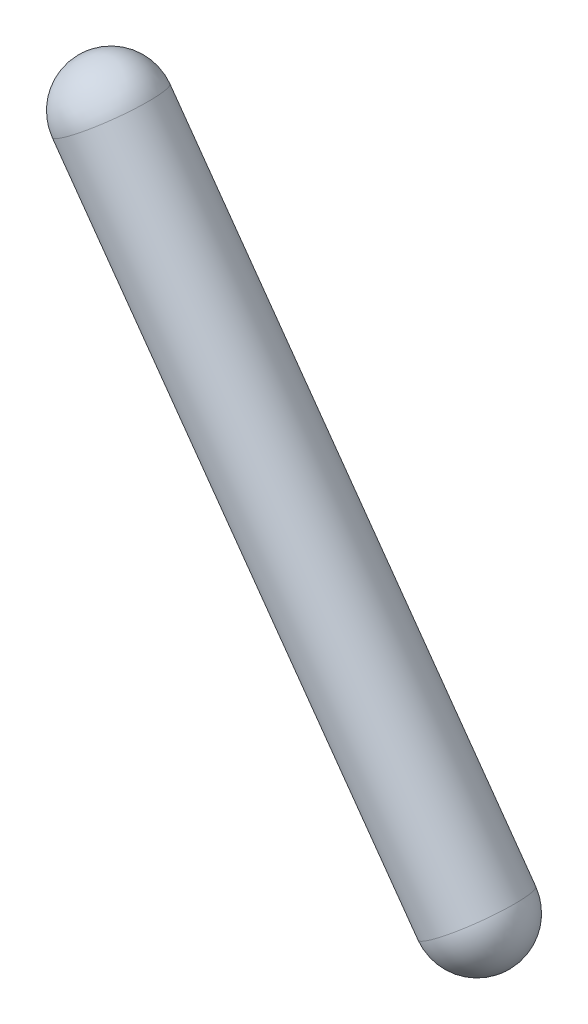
ISO-10303-21;
HEADER;
FILE_DESCRIPTION(('STEP AP214'),'2;1');
FILE_NAME('part.step','',(''),(''),'','','');
FILE_SCHEMA(('AUTOMOTIVE_DESIGN { 1 0 10303 214 1 1 1 1 }'));
ENDSEC;
DATA;
#1=APPLICATION_CONTEXT('core data for automotive mechanical design processes');
#2=APPLICATION_PROTOCOL_DEFINITION('international standard','automotive_design',2000,#1);
#3=PRODUCT_CONTEXT('',#1,'mechanical');
#4=PRODUCT('Part','Part','',(#3));
#5=PRODUCT_RELATED_PRODUCT_CATEGORY('part','',(#4));
#6=PRODUCT_DEFINITION_FORMATION('','',#4);
#7=PRODUCT_DEFINITION_CONTEXT('part definition',#1,'design');
#8=PRODUCT_DEFINITION('design','',#6,#7);
#9=PRODUCT_DEFINITION_SHAPE('','',#8);
#10=(LENGTH_UNIT() NAMED_UNIT(*) SI_UNIT(.MILLI.,.METRE.));
#11=(NAMED_UNIT(*) PLANE_ANGLE_UNIT() SI_UNIT($,.RADIAN.));
#12=(NAMED_UNIT(*) SI_UNIT($,.STERADIAN.) SOLID_ANGLE_UNIT());
#13=UNCERTAINTY_MEASURE_WITH_UNIT(LENGTH_MEASURE(1.E-05),#10,'distance_accuracy_value','');
#14=(GEOMETRIC_REPRESENTATION_CONTEXT(3) GLOBAL_UNCERTAINTY_ASSIGNED_CONTEXT((#13)) GLOBAL_UNIT_ASSIGNED_CONTEXT((#10,
#11,#12)) REPRESENTATION_CONTEXT('',''));
#15=CARTESIAN_POINT('',(0.,0.,0.));
#16=DIRECTION('',(0.,0.,1.));
#17=DIRECTION('',(1.,0.,0.));
#18=AXIS2_PLACEMENT_3D('',#15,#16,#17);
#19=CARTESIAN_POINT('',(-68.,-97.,0.));
#20=DIRECTION('',(-0.581238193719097,0.813733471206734,0.));
#21=DIRECTION('',(0.,0.,-1.));
#22=AXIS2_PLACEMENT_3D('',#19,#20,#21);
#23=CYLINDRICAL_SURFACE('',#22,1.49999999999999);
#24=CARTESIAN_POINT('',(-80.,-80.2,0.));
#25=DIRECTION('',(-0.581238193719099,0.813733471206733,0.));
#26=DIRECTION('',(-0.813733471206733,-0.581238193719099,0.));
#27=AXIS2_PLACEMENT_3D('',#24,#25,#26);
#28=CIRCLE('',#27,1.5);
#29=CARTESIAN_POINT('',(-80.,-80.2,-1.49999999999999));
#30=VERTEX_POINT('',#29);
#31=CARTESIAN_POINT('',(-80.,-80.2,1.5));
#32=VERTEX_POINT('',#31);
#33=EDGE_CURVE('E11',#30,#32,#28,.T.);
#34=ORIENTED_EDGE('',*,*,#33,.F.);
#35=CARTESIAN_POINT('',(-80.,-80.2,0.));
#36=DIRECTION('',(0.581238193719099,-0.813733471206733,0.));
#37=DIRECTION('',(0.813733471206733,0.581238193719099,0.));
#38=AXIS2_PLACEMENT_3D('',#35,#36,#37);
#39=CIRCLE('',#38,1.5);
#40=EDGE_CURVE('E24',#30,#32,#39,.T.);
#41=ORIENTED_EDGE('',*,*,#40,.T.);
#42=EDGE_LOOP('',(#34,#41));
#43=FACE_BOUND('',#42,.T.);
#44=CARTESIAN_POINT('',(-68.,-97.,0.));
#45=DIRECTION('',(-0.581238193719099,0.813733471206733,0.));
#46=DIRECTION('',(-0.813733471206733,-0.581238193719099,0.));
#47=AXIS2_PLACEMENT_3D('',#44,#45,#46);
#48=CIRCLE('',#47,1.5);
#49=CARTESIAN_POINT('',(-68.,-97.,-1.5));
#50=VERTEX_POINT('',#49);
#51=CARTESIAN_POINT('',(-68.,-97.,1.49999999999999));
#52=VERTEX_POINT('',#51);
#53=EDGE_CURVE('E41',#50,#52,#48,.T.);
#54=ORIENTED_EDGE('',*,*,#53,.T.);
#55=CARTESIAN_POINT('',(-68.,-97.,0.));
#56=DIRECTION('',(0.581238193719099,-0.813733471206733,0.));
#57=DIRECTION('',(0.813733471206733,0.581238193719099,0.));
#58=AXIS2_PLACEMENT_3D('',#55,#56,#57);
#59=CIRCLE('',#58,1.5);
#60=EDGE_CURVE('E30',#50,#52,#59,.T.);
#61=ORIENTED_EDGE('',*,*,#60,.F.);
#62=EDGE_LOOP('',(#54,#61));
#63=FACE_BOUND('',#62,.T.);
#64=ADVANCED_FACE('F16',(#43,#63),#23,.T.);
#65=CARTESIAN_POINT('',(-80.,-80.2,0.));
#66=DIRECTION('',(0.,0.,1.));
#67=DIRECTION('',(-0.813733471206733,-0.581238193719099,0.));
#68=AXIS2_PLACEMENT_3D('',#65,#66,#67);
#69=SPHERICAL_SURFACE('',#68,1.5);
#70=CARTESIAN_POINT('',(-80.,-80.2,0.));
#71=DIRECTION('',(-0.581238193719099,0.813733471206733,0.));
#72=DIRECTION('',(-0.813733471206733,-0.581238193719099,0.));
#73=AXIS2_PLACEMENT_3D('',#70,#71,#72);
#74=SPHERICAL_SURFACE('',#73,1.5);
#75=ORIENTED_EDGE('',*,*,#33,.T.);
#76=ORIENTED_EDGE('',*,*,#40,.F.);
#77=EDGE_LOOP('',(#75,#76));
#78=FACE_BOUND('',#77,.T.);
#79=ADVANCED_FACE('F62',(#78),#74,.T.);
#80=CARTESIAN_POINT('',(-68.,-97.,0.));
#81=DIRECTION('',(0.,0.,1.));
#82=DIRECTION('',(0.813733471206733,0.581238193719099,0.));
#83=AXIS2_PLACEMENT_3D('',#80,#81,#82);
#84=SPHERICAL_SURFACE('',#83,1.5);
#85=CARTESIAN_POINT('',(-68.,-97.,0.));
#86=DIRECTION('',(0.581238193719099,-0.813733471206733,0.));
#87=DIRECTION('',(0.813733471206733,0.581238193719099,0.));
#88=AXIS2_PLACEMENT_3D('',#85,#86,#87);
#89=SPHERICAL_SURFACE('',#88,1.5);
#90=ORIENTED_EDGE('',*,*,#60,.T.);
#91=ORIENTED_EDGE('',*,*,#53,.F.);
#92=EDGE_LOOP('',(#90,#91));
#93=FACE_BOUND('',#92,.T.);
#94=ADVANCED_FACE('F44',(#93),#89,.T.);
#95=CLOSED_SHELL('',(#64,#79,#94));
#96=MANIFOLD_SOLID_BREP('B1',#95);
#97=ADVANCED_BREP_SHAPE_REPRESENTATION('',(#18,#96),#14);
#98=SHAPE_DEFINITION_REPRESENTATION(#9,#97);
ENDSEC;
END-ISO-10303-21;
